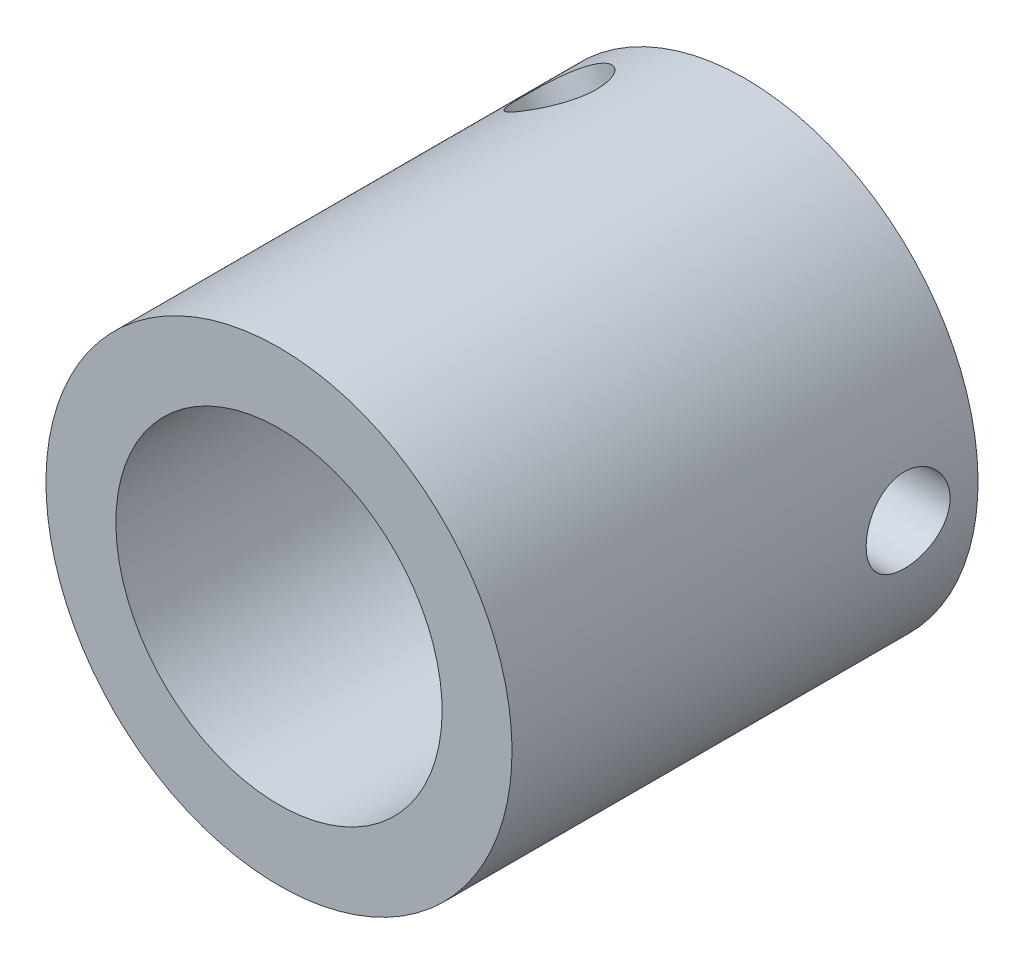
ISO-10303-21;
HEADER;
FILE_DESCRIPTION(('STEP AP214'),'2;1');
FILE_NAME('part.step','',(''),(''),'','','');
FILE_SCHEMA(('AUTOMOTIVE_DESIGN { 1 0 10303 214 1 1 1 1 }'));
ENDSEC;
DATA;
#1=APPLICATION_CONTEXT('core data for automotive mechanical design processes');
#2=APPLICATION_PROTOCOL_DEFINITION('international standard','automotive_design',2000,#1);
#3=PRODUCT_CONTEXT('',#1,'mechanical');
#4=PRODUCT('Part','Part','',(#3));
#5=PRODUCT_RELATED_PRODUCT_CATEGORY('part','',(#4));
#6=PRODUCT_DEFINITION_FORMATION('','',#4);
#7=PRODUCT_DEFINITION_CONTEXT('part definition',#1,'design');
#8=PRODUCT_DEFINITION('design','',#6,#7);
#9=PRODUCT_DEFINITION_SHAPE('','',#8);
#10=(LENGTH_UNIT() NAMED_UNIT(*) SI_UNIT(.MILLI.,.METRE.));
#11=(NAMED_UNIT(*) PLANE_ANGLE_UNIT() SI_UNIT($,.RADIAN.));
#12=(NAMED_UNIT(*) SI_UNIT($,.STERADIAN.) SOLID_ANGLE_UNIT());
#13=UNCERTAINTY_MEASURE_WITH_UNIT(LENGTH_MEASURE(1.E-05),#10,'distance_accuracy_value','');
#14=(GEOMETRIC_REPRESENTATION_CONTEXT(3) GLOBAL_UNCERTAINTY_ASSIGNED_CONTEXT((#13)) GLOBAL_UNIT_ASSIGNED_CONTEXT((#10,
#11,#12)) REPRESENTATION_CONTEXT('',''));
#15=CARTESIAN_POINT('',(0.,0.,0.));
#16=DIRECTION('',(0.,0.,1.));
#17=DIRECTION('',(1.,0.,0.));
#18=AXIS2_PLACEMENT_3D('',#15,#16,#17);
#19=CARTESIAN_POINT('',(10.,0.,3.));
#20=DIRECTION('',(1.,0.,0.));
#21=DIRECTION('',(0.,0.,1.));
#22=AXIS2_PLACEMENT_3D('',#19,#20,#21);
#23=CYLINDRICAL_SURFACE('',#22,1.8);
#24=CARTESIAN_POINT('',(7.,0.,1.2));
#25=CARTESIAN_POINT('',(6.99999696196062,-0.099240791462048,1.20000512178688));
#26=CARTESIAN_POINT('',(6.99786614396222,-0.198597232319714,1.20824378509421));
#27=CARTESIAN_POINT('',(6.98956324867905,-0.394546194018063,1.24095616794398));
#28=CARTESIAN_POINT('',(6.98338362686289,-0.491133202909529,1.2654601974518));
#29=CARTESIAN_POINT('',(6.96766786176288,-0.678551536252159,1.32986101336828));
#30=CARTESIAN_POINT('',(6.95813762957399,-0.769392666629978,1.36973070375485));
#31=CARTESIAN_POINT('',(6.93673479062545,-0.943067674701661,1.46364971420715));
#32=CARTESIAN_POINT('',(6.92486276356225,-1.02590352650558,1.51769552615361));
#33=CARTESIAN_POINT('',(6.89977071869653,-1.18305816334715,1.63968386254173));
#34=CARTESIAN_POINT('',(6.88652883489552,-1.25717810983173,1.70787808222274));
#35=CARTESIAN_POINT('',(6.86033226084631,-1.39306905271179,1.85569215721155));
#36=CARTESIAN_POINT('',(6.84737762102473,-1.45483789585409,1.93531400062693));
#37=CARTESIAN_POINT('',(6.82300297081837,-1.56521104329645,2.10527107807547));
#38=CARTESIAN_POINT('',(6.81161044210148,-1.61359192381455,2.19575570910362));
#39=CARTESIAN_POINT('',(6.79196771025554,-1.69437746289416,2.38391385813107));
#40=CARTESIAN_POINT('',(6.7837169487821,-1.72678496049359,2.481586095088));
#41=CARTESIAN_POINT('',(6.77151560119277,-1.77402502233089,2.67916770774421));
#42=CARTESIAN_POINT('',(6.76747790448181,-1.78921419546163,2.77898631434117));
#43=CARTESIAN_POINT('',(6.76389931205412,-1.80269763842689,2.97983039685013));
#44=CARTESIAN_POINT('',(6.76435764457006,-1.80099480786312,3.0808556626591));
#45=CARTESIAN_POINT('',(6.76964115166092,-1.78102655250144,3.27849027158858));
#46=CARTESIAN_POINT('',(6.77435352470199,-1.76318893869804,3.3751463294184));
#47=CARTESIAN_POINT('',(6.78743407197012,-1.71214085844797,3.56404630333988));
#48=CARTESIAN_POINT('',(6.79580254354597,-1.67892914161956,3.65628985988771));
#49=CARTESIAN_POINT('',(6.81535434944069,-1.59771670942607,3.83488185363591));
#50=CARTESIAN_POINT('',(6.82656665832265,-1.54956254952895,3.92115720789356));
#51=CARTESIAN_POINT('',(6.85052581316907,-1.43994268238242,4.0845492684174));
#52=CARTESIAN_POINT('',(6.86327284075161,-1.37847539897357,4.16166488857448));
#53=CARTESIAN_POINT('',(6.88933626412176,-1.24178154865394,4.30699106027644));
#54=CARTESIAN_POINT('',(6.90265825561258,-1.16619685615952,4.37486415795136));
#55=CARTESIAN_POINT('',(6.92803148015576,-1.00452224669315,4.49706525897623));
#56=CARTESIAN_POINT('',(6.94008216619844,-0.918427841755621,4.55138744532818));
#57=CARTESIAN_POINT('',(6.96162243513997,-0.73765468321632,4.64507793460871));
#58=CARTESIAN_POINT('',(6.97110010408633,-0.642938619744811,4.6843770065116));
#59=CARTESIAN_POINT('',(6.98632522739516,-0.448060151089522,4.74632580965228));
#60=CARTESIAN_POINT('',(6.99208043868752,-0.34790954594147,4.76901017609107));
#61=CARTESIAN_POINT('',(6.99709554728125,-0.205771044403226,4.78867719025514));
#62=CARTESIAN_POINT('',(6.99818199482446,-0.164745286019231,4.79291906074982));
#63=CARTESIAN_POINT('',(6.99963485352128,-0.0824863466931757,4.79858153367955));
#64=CARTESIAN_POINT('',(7.00000126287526,-0.0412531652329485,4.80000212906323));
#65=CARTESIAN_POINT('',(6.99999696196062,0.0992407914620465,4.79999487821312));
#66=CARTESIAN_POINT('',(6.99786614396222,0.198597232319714,4.79175621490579));
#67=CARTESIAN_POINT('',(6.98956324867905,0.394546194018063,4.75904383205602));
#68=CARTESIAN_POINT('',(6.98338362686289,0.49113320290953,4.7345398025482));
#69=CARTESIAN_POINT('',(6.96766786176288,0.67855153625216,4.67013898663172));
#70=CARTESIAN_POINT('',(6.95813762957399,0.769392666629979,4.63026929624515));
#71=CARTESIAN_POINT('',(6.93673479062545,0.943067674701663,4.53635028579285));
#72=CARTESIAN_POINT('',(6.92486276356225,1.02590352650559,4.48230447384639));
#73=CARTESIAN_POINT('',(6.89977071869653,1.18305816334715,4.36031613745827));
#74=CARTESIAN_POINT('',(6.88652883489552,1.25717810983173,4.29212191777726));
#75=CARTESIAN_POINT('',(6.86033226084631,1.39306905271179,4.14430784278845));
#76=CARTESIAN_POINT('',(6.84737762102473,1.45483789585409,4.06468599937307));
#77=CARTESIAN_POINT('',(6.82300297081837,1.56521104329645,3.89472892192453));
#78=CARTESIAN_POINT('',(6.81161044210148,1.61359192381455,3.80424429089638));
#79=CARTESIAN_POINT('',(6.79196771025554,1.69437746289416,3.61608614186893));
#80=CARTESIAN_POINT('',(6.7837169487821,1.72678496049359,3.518413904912));
#81=CARTESIAN_POINT('',(6.77151560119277,1.77402502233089,3.32083229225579));
#82=CARTESIAN_POINT('',(6.76747790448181,1.78921419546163,3.22101368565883));
#83=CARTESIAN_POINT('',(6.76389931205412,1.80269763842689,3.02016960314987));
#84=CARTESIAN_POINT('',(6.76435764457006,1.80099480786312,2.91914433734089));
#85=CARTESIAN_POINT('',(6.76964115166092,1.78102655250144,2.72150972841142));
#86=CARTESIAN_POINT('',(6.77435352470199,1.76318893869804,2.6248536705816));
#87=CARTESIAN_POINT('',(6.78743407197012,1.71214085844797,2.43595369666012));
#88=CARTESIAN_POINT('',(6.79580254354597,1.67892914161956,2.34371014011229));
#89=CARTESIAN_POINT('',(6.81535434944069,1.59771670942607,2.16511814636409));
#90=CARTESIAN_POINT('',(6.82656665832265,1.54956254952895,2.07884279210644));
#91=CARTESIAN_POINT('',(6.85052581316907,1.43994268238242,1.9154507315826));
#92=CARTESIAN_POINT('',(6.86327284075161,1.37847539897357,1.83833511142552));
#93=CARTESIAN_POINT('',(6.88933626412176,1.24178154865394,1.69300893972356));
#94=CARTESIAN_POINT('',(6.90265825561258,1.16619685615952,1.62513584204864));
#95=CARTESIAN_POINT('',(6.92803148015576,1.00452224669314,1.50293474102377));
#96=CARTESIAN_POINT('',(6.94008216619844,0.918427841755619,1.44861255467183));
#97=CARTESIAN_POINT('',(6.96162243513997,0.737654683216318,1.35492206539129));
#98=CARTESIAN_POINT('',(6.97110010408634,0.64293861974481,1.3156229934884));
#99=CARTESIAN_POINT('',(6.98632522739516,0.448060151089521,1.25367419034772));
#100=CARTESIAN_POINT('',(6.99208043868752,0.347909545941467,1.23098982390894));
#101=CARTESIAN_POINT('',(6.99709554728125,0.205771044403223,1.21132280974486));
#102=CARTESIAN_POINT('',(6.99818199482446,0.164745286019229,1.20708093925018));
#103=CARTESIAN_POINT('',(6.99963485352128,0.0824863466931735,1.20141846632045));
#104=CARTESIAN_POINT('',(7.00000126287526,0.0412531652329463,1.19999787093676));
#105=CARTESIAN_POINT('',(7.,0.,1.2));
#106=B_SPLINE_CURVE_WITH_KNOTS('',3,(#24,#25,#26,#27,#28,#29,#30,#31,#32,#33,#34,#35,#36,#37,
#38,#39,#40,#41,#42,#43,#44,#45,#46,#47,#48,#49,#50,#51,#52,#53,#54,#55,#56,#57,#58,#59,#60,#61,
#62,#63,#64,#65,#66,#67,#68,#69,#70,#71,#72,#73,#74,#75,#76,#77,#78,#79,#80,#81,#82,#83,#84,#85,
#86,#87,#88,#89,#90,#91,#92,#93,#94,#95,#96,#97,#98,#99,#100,#101,#102,#103,#104,#105),
.UNSPECIFIED.,.T.,.F.,(4,2,2,2,2,2,2,2,2,2,2,2,2,2,2,2,2,2,2,2,2,2,2,2,2,2,2,2,2,2,2,2,2,2,2,2,
2,2,2,2,4),(0.,0.297564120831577,0.595684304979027,0.893281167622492,1.19080445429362,
1.49416126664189,1.79757091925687,2.10577452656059,2.41392333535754,2.71556628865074,
3.01715746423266,3.31097913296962,3.60482470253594,3.90179364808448,4.19879777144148,
4.50473171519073,4.81079676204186,5.11825571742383,5.42507190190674,5.54876530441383,
5.67245901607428,5.97002313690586,6.26814332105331,6.56574018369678,6.8632634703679,
7.16662028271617,7.47002993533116,7.77823354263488,8.08638235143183,8.38802530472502,
8.68961648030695,8.98343814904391,9.27728371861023,9.57425266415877,9.87125678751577,
10.177190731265,10.4832557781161,10.7907147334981,11.097530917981,11.2212243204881,
11.3449180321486),.UNSPECIFIED.);
#107=CARTESIAN_POINT('',(7.,0.,1.2));
#108=VERTEX_POINT('',#107);
#109=EDGE_CURVE('E16',#108,#108,#106,.T.);
#110=ORIENTED_EDGE('',*,*,#109,.T.);
#111=EDGE_LOOP('',(#110));
#112=FACE_BOUND('',#111,.T.);
#113=CARTESIAN_POINT('',(10.,0.,1.2));
#114=CARTESIAN_POINT('',(9.99999792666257,-0.100138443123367,1.20000468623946));
#115=CARTESIAN_POINT('',(9.99847890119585,-0.200403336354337,1.20839204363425));
#116=CARTESIAN_POINT('',(9.99256124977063,-0.398189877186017,1.2417225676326));
#117=CARTESIAN_POINT('',(9.98815683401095,-0.495705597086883,1.26669902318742));
#118=CARTESIAN_POINT('',(9.97696172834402,-0.684989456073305,1.33242473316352));
#119=CARTESIAN_POINT('',(9.9701741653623,-0.776764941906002,1.37315332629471));
#120=CARTESIAN_POINT('',(9.95495763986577,-0.952142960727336,1.46917704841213));
#121=CARTESIAN_POINT('',(9.9465292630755,-1.03574839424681,1.52446698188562));
#122=CARTESIAN_POINT('',(9.92885621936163,-1.19338882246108,1.64870648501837));
#123=CARTESIAN_POINT('',(9.91960421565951,-1.26731946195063,1.7177874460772));
#124=CARTESIAN_POINT('',(9.90138142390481,-1.40261092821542,1.86736851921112));
#125=CARTESIAN_POINT('',(9.89241066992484,-1.46397023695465,1.94787000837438));
#126=CARTESIAN_POINT('',(9.87569637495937,-1.57279517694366,2.11872462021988));
#127=CARTESIAN_POINT('',(9.86796217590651,-1.6201571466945,2.20914476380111));
#128=CARTESIAN_POINT('',(9.85469826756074,-1.69897904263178,2.39681974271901));
#129=CARTESIAN_POINT('',(9.84916836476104,-1.73044036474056,2.49407397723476));
#130=CARTESIAN_POINT('',(9.84101185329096,-1.77623939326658,2.6915561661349));
#131=CARTESIAN_POINT('',(9.8383548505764,-1.79075649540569,2.79174123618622));
#132=CARTESIAN_POINT('',(9.83615323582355,-1.80281159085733,2.99315783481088));
#133=CARTESIAN_POINT('',(9.83660837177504,-1.80035095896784,3.09438927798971));
#134=CARTESIAN_POINT('',(9.84055190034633,-1.77866619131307,3.29373143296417));
#135=CARTESIAN_POINT('',(9.84400352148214,-1.75964526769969,3.39186508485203));
#136=CARTESIAN_POINT('',(9.85349347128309,-1.70569919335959,3.5835259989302));
#137=CARTESIAN_POINT('',(9.85953192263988,-1.67077328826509,3.67705304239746));
#138=CARTESIAN_POINT('',(9.87355429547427,-1.58580593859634,3.85744754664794));
#139=CARTESIAN_POINT('',(9.88154890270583,-1.53568109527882,3.94427486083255));
#140=CARTESIAN_POINT('',(9.89857482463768,-1.42180184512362,4.10835629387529));
#141=CARTESIAN_POINT('',(9.90760615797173,-1.35804719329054,4.18561024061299));
#142=CARTESIAN_POINT('',(9.92584751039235,-1.21763063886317,4.32952111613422));
#143=CARTESIAN_POINT('',(9.93505823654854,-1.14079701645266,4.39601049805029));
#144=CARTESIAN_POINT('',(9.95250580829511,-0.976936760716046,4.51520980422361));
#145=CARTESIAN_POINT('',(9.96074222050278,-0.889905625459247,4.56791360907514));
#146=CARTESIAN_POINT('',(9.97532870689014,-0.707929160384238,4.65806284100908));
#147=CARTESIAN_POINT('',(9.98167520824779,-0.612969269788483,4.69547941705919));
#148=CARTESIAN_POINT('',(9.99172969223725,-0.418096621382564,4.75370936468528));
#149=CARTESIAN_POINT('',(9.99544322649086,-0.318194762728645,4.77455768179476));
#150=CARTESIAN_POINT('',(9.99842222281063,-0.181296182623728,4.79121663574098));
#151=CARTESIAN_POINT('',(9.99901260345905,-0.145122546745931,4.79450767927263));
#152=CARTESIAN_POINT('',(9.99980186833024,-0.0726381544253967,4.7989002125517));
#153=CARTESIAN_POINT('',(10.0000007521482,-0.0363273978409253,4.80000170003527));
#154=CARTESIAN_POINT('',(9.99999792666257,0.100138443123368,4.79999531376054));
#155=CARTESIAN_POINT('',(9.99847890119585,0.200403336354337,4.79160795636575));
#156=CARTESIAN_POINT('',(9.99256124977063,0.398189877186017,4.7582774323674));
#157=CARTESIAN_POINT('',(9.98815683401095,0.495705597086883,4.73330097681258));
#158=CARTESIAN_POINT('',(9.97696172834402,0.684989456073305,4.66757526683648));
#159=CARTESIAN_POINT('',(9.9701741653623,0.776764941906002,4.62684667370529));
#160=CARTESIAN_POINT('',(9.95495763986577,0.952142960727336,4.53082295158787));
#161=CARTESIAN_POINT('',(9.9465292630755,1.03574839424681,4.47553301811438));
#162=CARTESIAN_POINT('',(9.92885621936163,1.19338882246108,4.35129351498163));
#163=CARTESIAN_POINT('',(9.91960421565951,1.26731946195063,4.2822125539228));
#164=CARTESIAN_POINT('',(9.90138142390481,1.40261092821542,4.13263148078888));
#165=CARTESIAN_POINT('',(9.89241066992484,1.46397023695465,4.05212999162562));
#166=CARTESIAN_POINT('',(9.87569637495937,1.57279517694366,3.88127537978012));
#167=CARTESIAN_POINT('',(9.86796217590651,1.6201571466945,3.79085523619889));
#168=CARTESIAN_POINT('',(9.85469826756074,1.69897904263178,3.60318025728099));
#169=CARTESIAN_POINT('',(9.84916836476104,1.73044036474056,3.50592602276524));
#170=CARTESIAN_POINT('',(9.84101185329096,1.77623939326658,3.3084438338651));
#171=CARTESIAN_POINT('',(9.8383548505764,1.79075649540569,3.20825876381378));
#172=CARTESIAN_POINT('',(9.83615323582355,1.80281159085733,3.00684216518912));
#173=CARTESIAN_POINT('',(9.83660837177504,1.80035095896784,2.90561072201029));
#174=CARTESIAN_POINT('',(9.84055190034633,1.77866619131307,2.70626856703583));
#175=CARTESIAN_POINT('',(9.84400352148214,1.75964526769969,2.60813491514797));
#176=CARTESIAN_POINT('',(9.85349347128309,1.70569919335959,2.4164740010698));
#177=CARTESIAN_POINT('',(9.85953192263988,1.67077328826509,2.32294695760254));
#178=CARTESIAN_POINT('',(9.87355429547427,1.58580593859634,2.14255245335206));
#179=CARTESIAN_POINT('',(9.88154890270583,1.53568109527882,2.05572513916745));
#180=CARTESIAN_POINT('',(9.89857482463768,1.42180184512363,1.89164370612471));
#181=CARTESIAN_POINT('',(9.90760615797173,1.35804719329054,1.81438975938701));
#182=CARTESIAN_POINT('',(9.92584751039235,1.21763063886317,1.67047888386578));
#183=CARTESIAN_POINT('',(9.93505823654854,1.14079701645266,1.60398950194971));
#184=CARTESIAN_POINT('',(9.95250580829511,0.976936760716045,1.48479019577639));
#185=CARTESIAN_POINT('',(9.96074222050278,0.889905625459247,1.43208639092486));
#186=CARTESIAN_POINT('',(9.97532870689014,0.707929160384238,1.34193715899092));
#187=CARTESIAN_POINT('',(9.98167520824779,0.612969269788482,1.30452058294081));
#188=CARTESIAN_POINT('',(9.99172969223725,0.418096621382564,1.24629063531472));
#189=CARTESIAN_POINT('',(9.99544322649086,0.318194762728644,1.22544231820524));
#190=CARTESIAN_POINT('',(9.99842222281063,0.181296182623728,1.20878336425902));
#191=CARTESIAN_POINT('',(9.99901260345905,0.145122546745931,1.20549232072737));
#192=CARTESIAN_POINT('',(9.99980186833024,0.0726381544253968,1.2010997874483));
#193=CARTESIAN_POINT('',(10.0000007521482,0.0363273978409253,1.19999829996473));
#194=CARTESIAN_POINT('',(10.,0.,1.2));
#195=B_SPLINE_CURVE_WITH_KNOTS('',3,(#113,#114,#115,#116,#117,#118,#119,#120,#121,#122,#123,
#124,#125,#126,#127,#128,#129,#130,#131,#132,#133,#134,#135,#136,#137,#138,#139,#140,#141,#142,
#143,#144,#145,#146,#147,#148,#149,#150,#151,#152,#153,#154,#155,#156,#157,#158,#159,#160,#161,
#162,#163,#164,#165,#166,#167,#168,#169,#170,#171,#172,#173,#174,#175,#176,#177,#178,#179,#180,
#181,#182,#183,#184,#185,#186,#187,#188,#189,#190,#191,#192,#193,#194),.UNSPECIFIED.,.T.,.F.,(4,
2,2,2,2,2,2,2,2,2,2,2,2,2,2,2,2,2,2,2,2,2,2,2,2,2,2,2,2,2,2,2,2,2,2,2,2,2,2,2,4),(0.,
0.300276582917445,0.601157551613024,0.901645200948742,1.20202578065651,1.50541792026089,
1.808846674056,2.11446927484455,2.42006504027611,2.72239510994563,3.02470069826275,
3.3233481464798,3.62200976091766,3.92234077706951,4.22267719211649,4.52731338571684,
4.83208457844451,5.13742832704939,5.44212632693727,5.55105807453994,5.65998993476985,
5.9602665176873,6.26114748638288,6.56163513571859,6.86201571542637,7.16540785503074,
7.46883660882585,7.7744592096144,8.08005497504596,8.38238504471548,8.6846906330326,
8.98333808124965,9.28199969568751,9.58233071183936,9.88266712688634,10.1873033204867,
10.4920745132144,10.7974182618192,11.1021162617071,11.2110480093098,11.3199798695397),.UNSPECIFIED.);
#196=CARTESIAN_POINT('',(10.,0.,1.2));
#197=VERTEX_POINT('',#196);
#198=EDGE_CURVE('E45',#197,#197,#195,.T.);
#199=ORIENTED_EDGE('',*,*,#198,.F.);
#200=EDGE_LOOP('',(#199));
#201=FACE_BOUND('',#200,.T.);
#202=ADVANCED_FACE('F12',(#112,#201),#23,.F.);
#203=CARTESIAN_POINT('',(0.,0.,45.4558441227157));
#204=DIRECTION('',(0.,0.,-1.));
#205=DIRECTION('',(0.,1.,0.));
#206=AXIS2_PLACEMENT_3D('',#203,#204,#205);
#207=CYLINDRICAL_SURFACE('',#206,7.);
#208=CARTESIAN_POINT('',(0.,0.,0.));
#209=DIRECTION('',(0.,0.,-1.));
#210=DIRECTION('',(0.,1.,0.));
#211=AXIS2_PLACEMENT_3D('',#208,#209,#210);
#212=CIRCLE('',#211,7.);
#213=CARTESIAN_POINT('',(0.,7.,0.));
#214=VERTEX_POINT('',#213);
#215=EDGE_CURVE('E51',#214,#214,#212,.T.);
#216=ORIENTED_EDGE('',*,*,#215,.T.);
#217=EDGE_LOOP('',(#216));
#218=FACE_BOUND('',#217,.T.);
#219=CARTESIAN_POINT('',(0.,0.,20.));
#220=DIRECTION('',(0.,0.,-1.));
#221=DIRECTION('',(0.,1.,0.));
#222=AXIS2_PLACEMENT_3D('',#219,#220,#221);
#223=CIRCLE('',#222,7.);
#224=CARTESIAN_POINT('',(0.,7.,20.));
#225=VERTEX_POINT('',#224);
#226=EDGE_CURVE('E52',#225,#225,#223,.T.);
#227=ORIENTED_EDGE('',*,*,#226,.F.);
#228=EDGE_LOOP('',(#227));
#229=FACE_BOUND('',#228,.T.);
#230=CARTESIAN_POINT('',(-4.94115263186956,4.9583274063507,3.));
#231=CARTESIAN_POINT('',(-4.94114986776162,4.95833295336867,3.09917960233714));
#232=CARTESIAN_POINT('',(-4.93512555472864,4.96435629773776,3.19847523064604));
#233=CARTESIAN_POINT('',(-4.9111147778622,4.98810828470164,3.39429739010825));
#234=CARTESIAN_POINT('',(-4.89310582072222,5.00585893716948,3.49081835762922));
#235=CARTESIAN_POINT('',(-4.84547659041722,5.05197446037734,3.67809685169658));
#236=CARTESIAN_POINT('',(-4.81587791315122,5.08031958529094,3.76886473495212));
#237=CARTESIAN_POINT('',(-4.74556047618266,5.14606276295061,3.94241571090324));
#238=CARTESIAN_POINT('',(-4.70484434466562,5.18345867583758,4.02520068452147));
#239=CARTESIAN_POINT('',(-4.61192603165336,5.2663160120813,4.18240686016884));
#240=CARTESIAN_POINT('',(-4.55949940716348,5.3119311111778,4.25661446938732));
#241=CARTESIAN_POINT('',(-4.44450093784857,5.408515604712,4.39267629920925));
#242=CARTESIAN_POINT('',(-4.381927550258,5.45948581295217,4.45452863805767));
#243=CARTESIAN_POINT('',(-4.24672214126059,5.56532283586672,4.56499418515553));
#244=CARTESIAN_POINT('',(-4.17395499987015,5.62023614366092,4.61339798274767));
#245=CARTESIAN_POINT('',(-4.02062080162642,5.73092800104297,4.6942285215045));
#246=CARTESIAN_POINT('',(-3.94005502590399,5.78670640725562,4.72665788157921));
#247=CARTESIAN_POINT('',(-3.77491722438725,5.89572518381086,4.77393624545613));
#248=CARTESIAN_POINT('',(-3.69046763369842,5.9489943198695,4.78914619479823));
#249=CARTESIAN_POINT('',(-3.51835268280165,6.05237683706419,4.80268805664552));
#250=CARTESIAN_POINT('',(-3.43068782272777,6.1024907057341,4.80102258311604));
#251=CARTESIAN_POINT('',(-3.25685288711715,6.19697287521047,4.78111823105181));
#252=CARTESIAN_POINT('',(-3.17069601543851,6.24144841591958,4.76326922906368));
#253=CARTESIAN_POINT('',(-3.00040889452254,6.32507314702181,4.71213230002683));
#254=CARTESIAN_POINT('',(-2.91627876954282,6.36422201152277,4.67884342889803));
#255=CARTESIAN_POINT('',(-2.75182121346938,6.43705305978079,4.59746222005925));
#256=CARTESIAN_POINT('',(-2.67153725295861,6.4706800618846,4.54923290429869));
#257=CARTESIAN_POINT('',(-2.51810766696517,6.53191912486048,4.43944755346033));
#258=CARTESIAN_POINT('',(-2.44496288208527,6.55953047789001,4.37788995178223));
#259=CARTESIAN_POINT('',(-2.30617433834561,6.60962666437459,4.24112531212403));
#260=CARTESIAN_POINT('',(-2.24080294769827,6.63194343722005,4.16557998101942));
#261=CARTESIAN_POINT('',(-2.12234581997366,6.67079811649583,4.00402244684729));
#262=CARTESIAN_POINT('',(-2.06926556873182,6.68733344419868,3.9180055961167));
#263=CARTESIAN_POINT('',(-1.97720587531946,6.71513159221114,3.73726593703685));
#264=CARTESIAN_POINT('',(-1.93831497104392,6.72636143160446,3.64249293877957));
#265=CARTESIAN_POINT('',(-1.87686115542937,6.74376963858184,3.44748876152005));
#266=CARTESIAN_POINT('',(-1.85426385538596,6.74995864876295,3.34726956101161));
#267=CARTESIAN_POINT('',(-1.83470392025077,6.75528566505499,3.20517722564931));
#268=CARTESIAN_POINT('',(-1.83049304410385,6.75642685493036,3.16426969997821));
#269=CARTESIAN_POINT('',(-1.8248703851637,6.75794764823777,3.08224810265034));
#270=CARTESIAN_POINT('',(-1.82345861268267,6.75832724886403,3.04113403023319));
#271=CARTESIAN_POINT('',(-1.82346736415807,6.75832778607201,2.90082039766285));
#272=CARTESIAN_POINT('',(-1.83169588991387,6.75612225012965,2.80152476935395));
#273=CARTESIAN_POINT('',(-1.86427110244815,6.74720430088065,2.60570260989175));
#274=CARTESIAN_POINT('',(-1.88864809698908,6.74048341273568,2.50918164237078));
#275=CARTESIAN_POINT('',(-1.95239992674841,6.72229305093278,2.32190314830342));
#276=CARTESIAN_POINT('',(-1.99174686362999,6.71083240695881,2.23113526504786));
#277=CARTESIAN_POINT('',(-2.08384084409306,6.68280730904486,2.05758428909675));
#278=CARTESIAN_POINT('',(-2.13658472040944,6.66624406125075,1.97479931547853));
#279=CARTESIAN_POINT('',(-2.25480043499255,6.6272031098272,1.81759313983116));
#280=CARTESIAN_POINT('',(-2.32051758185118,6.60460787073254,1.74338553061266));
#281=CARTESIAN_POINT('',(-2.4616614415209,6.55330852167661,1.60732370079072));
#282=CARTESIAN_POINT('',(-2.53708963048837,6.52460348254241,1.54547136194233));
#283=CARTESIAN_POINT('',(-2.696349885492,6.46043067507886,1.43500581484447));
#284=CARTESIAN_POINT('',(-2.78028977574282,6.42486913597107,1.38660201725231));
#285=CARTESIAN_POINT('',(-2.95281883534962,6.3474237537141,1.30577147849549));
#286=CARTESIAN_POINT('',(-3.0414072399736,6.30554094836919,1.27334211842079));
#287=CARTESIAN_POINT('',(-3.21838917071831,6.2170368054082,1.22606375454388));
#288=CARTESIAN_POINT('',(-3.30674639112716,6.1705358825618,1.21085380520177));
#289=CARTESIAN_POINT('',(-3.48233575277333,6.07317122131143,1.19731194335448));
#290=CARTESIAN_POINT('',(-3.56956806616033,6.0223081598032,1.19897741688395));
#291=CARTESIAN_POINT('',(-3.73830949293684,5.91900377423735,1.2188817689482));
#292=CARTESIAN_POINT('',(-3.81990487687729,5.8666275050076,1.23673077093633));
#293=CARTESIAN_POINT('',(-3.97746957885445,5.76096689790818,1.28786769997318));
#294=CARTESIAN_POINT('',(-4.05343855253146,5.70768250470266,1.32115657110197));
#295=CARTESIAN_POINT('',(-4.19874086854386,5.60167360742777,1.40253777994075));
#296=CARTESIAN_POINT('',(-4.26800468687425,5.54895915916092,1.45076709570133));
#297=CARTESIAN_POINT('',(-4.39775406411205,5.44670477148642,1.56055244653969));
#298=CARTESIAN_POINT('',(-4.45823858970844,5.39716520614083,1.62211004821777));
#299=CARTESIAN_POINT('',(-4.57101743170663,5.30201889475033,1.75887468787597));
#300=CARTESIAN_POINT('',(-4.62303001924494,5.25656399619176,1.8344200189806));
#301=CARTESIAN_POINT('',(-4.71590772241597,5.17340445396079,1.99597755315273));
#302=CARTESIAN_POINT('',(-4.75676786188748,5.1357032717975,2.08199440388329));
#303=CARTESIAN_POINT('',(-4.8268716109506,5.06987631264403,2.26273406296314));
#304=CARTESIAN_POINT('',(-4.85604238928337,5.04181072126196,2.35750706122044));
#305=CARTESIAN_POINT('',(-4.90184524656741,4.99729425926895,2.55251123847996));
#306=CARTESIAN_POINT('',(-4.91850373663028,4.98081892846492,2.65273043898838));
#307=CARTESIAN_POINT('',(-4.93289703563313,4.96654303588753,2.79482277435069));
#308=CARTESIAN_POINT('',(-4.93599077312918,4.96346690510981,2.83573030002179));
#309=CARTESIAN_POINT('',(-4.94011914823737,4.95935793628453,2.91775189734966));
#310=CARTESIAN_POINT('',(-4.94115377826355,4.9583251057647,2.95886596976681));
#311=CARTESIAN_POINT('',(-4.94115263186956,4.9583274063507,3.));
#312=B_SPLINE_CURVE_WITH_KNOTS('',3,(#230,#231,#232,#233,#234,#235,#236,#237,#238,#239,#240,
#241,#242,#243,#244,#245,#246,#247,#248,#249,#250,#251,#252,#253,#254,#255,#256,#257,#258,#259,
#260,#261,#262,#263,#264,#265,#266,#267,#268,#269,#270,#271,#272,#273,#274,#275,#276,#277,#278,
#279,#280,#281,#282,#283,#284,#285,#286,#287,#288,#289,#290,#291,#292,#293,#294,#295,#296,#297,
#298,#299,#300,#301,#302,#303,#304,#305,#306,#307,#308,#309,#310,#311),.UNSPECIFIED.,.T.,.F.,(4,
2,2,2,2,2,2,2,2,2,2,2,2,2,2,2,2,2,2,2,2,2,2,2,2,2,2,2,2,2,2,2,2,2,2,2,2,2,2,2,4),(0.,
0.297380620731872,0.595320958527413,0.892708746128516,1.19002629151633,1.49362376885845,
1.79726745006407,2.10540351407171,2.41348904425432,2.71498958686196,3.01644342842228,
3.3108224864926,3.60521954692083,3.902399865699,4.19961513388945,4.50528007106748,
4.81108117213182,5.1187590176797,5.42578557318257,5.54912160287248,5.67245808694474,
5.96983870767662,6.26777904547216,6.56516683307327,6.86248437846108,7.16608185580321,
7.46972553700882,7.77786160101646,8.08594713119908,8.38744767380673,8.68890151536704,
8.98328057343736,9.27767763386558,9.57485795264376,9.87207322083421,10.1777381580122,
10.4835392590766,10.7912171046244,11.0982436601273,11.2215796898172,11.3449161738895),.UNSPECIFIED.);
#313=CARTESIAN_POINT('',(-4.94115263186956,4.9583274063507,3.));
#314=VERTEX_POINT('',#313);
#315=EDGE_CURVE('E77',#314,#314,#312,.T.);
#316=ORIENTED_EDGE('',*,*,#315,.T.);
#317=EDGE_LOOP('',(#316));
#318=FACE_BOUND('',#317,.T.);
#319=ORIENTED_EDGE('',*,*,#109,.F.);
#320=EDGE_LOOP('',(#319));
#321=FACE_BOUND('',#320,.T.);
#322=ADVANCED_FACE('F62',(#218,#229,#318,#321),#207,.F.);
#323=CARTESIAN_POINT('',(0.,0.,20.));
#324=DIRECTION('',(0.,0.,1.));
#325=DIRECTION('',(0.,-1.,0.));
#326=AXIS2_PLACEMENT_3D('',#323,#324,#325);
#327=PLANE('',#326);
#328=ORIENTED_EDGE('',*,*,#226,.T.);
#329=EDGE_LOOP('',(#328));
#330=FACE_BOUND('',#329,.T.);
#331=CARTESIAN_POINT('',(0.,0.,20.));
#332=DIRECTION('',(0.,0.,-1.));
#333=DIRECTION('',(0.,1.,0.));
#334=AXIS2_PLACEMENT_3D('',#331,#332,#333);
#335=CIRCLE('',#334,10.);
#336=CARTESIAN_POINT('',(0.,10.,20.));
#337=VERTEX_POINT('',#336);
#338=EDGE_CURVE('E28',#337,#337,#335,.T.);
#339=ORIENTED_EDGE('',*,*,#338,.F.);
#340=EDGE_LOOP('',(#339));
#341=FACE_BOUND('',#340,.T.);
#342=ADVANCED_FACE('F64',(#330,#341),#327,.T.);
#343=CARTESIAN_POINT('',(0.,0.,0.));
#344=DIRECTION('',(0.,0.,1.));
#345=DIRECTION('',(0.,-1.,0.));
#346=AXIS2_PLACEMENT_3D('',#343,#344,#345);
#347=PLANE('',#346);
#348=ORIENTED_EDGE('',*,*,#215,.F.);
#349=EDGE_LOOP('',(#348));
#350=FACE_BOUND('',#349,.T.);
#351=CARTESIAN_POINT('',(0.,0.,0.));
#352=DIRECTION('',(0.,0.,-1.));
#353=DIRECTION('',(0.,1.,0.));
#354=AXIS2_PLACEMENT_3D('',#351,#352,#353);
#355=CIRCLE('',#354,10.);
#356=CARTESIAN_POINT('',(0.,10.,0.));
#357=VERTEX_POINT('',#356);
#358=EDGE_CURVE('E23',#357,#357,#355,.F.);
#359=ORIENTED_EDGE('',*,*,#358,.F.);
#360=EDGE_LOOP('',(#359));
#361=FACE_BOUND('',#360,.T.);
#362=ADVANCED_FACE('F71',(#350,#361),#347,.F.);
#363=CARTESIAN_POINT('',(-5.,8.66025403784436,3.));
#364=DIRECTION('',(-0.5,0.866025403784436,0.));
#365=DIRECTION('',(-0.866025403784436,-0.5,0.));
#366=AXIS2_PLACEMENT_3D('',#363,#364,#365);
#367=CYLINDRICAL_SURFACE('',#366,1.8);
#368=ORIENTED_EDGE('',*,*,#315,.F.);
#369=EDGE_LOOP('',(#368));
#370=FACE_BOUND('',#369,.T.);
#371=CARTESIAN_POINT('',(-6.4771787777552,7.6188027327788,3.));
#372=CARTESIAN_POINT('',(-6.47717580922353,7.61880698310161,2.89987639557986));
#373=CARTESIAN_POINT('',(-6.47068644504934,7.62433700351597,2.79962624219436));
#374=CARTESIAN_POINT('',(-6.44483457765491,7.64620053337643,2.60187040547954));
#375=CARTESIAN_POINT('',(-6.42544614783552,7.66255580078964,2.50437066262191));
#376=CARTESIAN_POINT('',(-6.37421453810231,7.70522498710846,2.31512059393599));
#377=CARTESIAN_POINT('',(-6.34238797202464,7.7315256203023,2.22336278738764));
#378=CARTESIAN_POINT('',(-6.26693437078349,7.79280979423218,2.04801451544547));
#379=CARTESIAN_POINT('',(-6.22331151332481,7.82779026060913,1.96442117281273));
#380=CARTESIAN_POINT('',(-6.1246056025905,7.90526230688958,1.8067676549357));
#381=CARTESIAN_POINT('',(-6.06940820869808,7.94782813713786,1.73281553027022));
#382=CARTESIAN_POINT('',(-5.94895032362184,8.03838649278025,1.5974824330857));
#383=CARTESIAN_POINT('',(-5.8836886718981,8.08637964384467,1.5361029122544));
#384=CARTESIAN_POINT('',(-5.74401420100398,8.18619010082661,1.42725636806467));
#385=CARTESIAN_POINT('',(-5.66954069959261,8.2380317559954,1.37988942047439));
#386=CARTESIAN_POINT('',(-5.5135724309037,8.34322213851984,1.30105739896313));
#387=CARTESIAN_POINT('',(-5.43207825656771,8.39657073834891,1.26959098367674));
#388=CARTESIAN_POINT('',(-5.26508535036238,8.50226626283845,1.22378199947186));
#389=CARTESIAN_POINT('',(-5.17963895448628,8.55461779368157,1.20925935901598));
#390=CARTESIAN_POINT('',(-5.00630940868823,8.6571937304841,1.19718952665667));
#391=CARTESIAN_POINT('',(-4.91842644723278,8.70741830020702,1.19964102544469));
#392=CARTESIAN_POINT('',(-4.74381824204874,8.80375038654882,1.22131086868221));
#393=CARTESIAN_POINT('',(-4.65709135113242,8.84989875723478,1.24033521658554));
#394=CARTESIAN_POINT('',(-4.48634526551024,8.93766900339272,1.29430467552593));
#395=CARTESIAN_POINT('',(-4.40232618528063,8.97929068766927,1.3292504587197));
#396=CARTESIAN_POINT('',(-4.23910830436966,9.05749423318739,1.41425989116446));
#397=CARTESIAN_POINT('',(-4.15993732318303,9.09404829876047,1.46440245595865));
#398=CARTESIAN_POINT('',(-4.00935476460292,9.16143489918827,1.57832003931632));
#399=CARTESIAN_POINT('',(-3.93794332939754,9.19226732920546,1.64209530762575));
#400=CARTESIAN_POINT('',(-3.80421461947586,9.24842115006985,1.78252710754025));
#401=CARTESIAN_POINT('',(-3.74203819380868,9.27365961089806,1.85935101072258));
#402=CARTESIAN_POINT('',(-3.63008074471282,9.31805527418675,2.02318310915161));
#403=CARTESIAN_POINT('',(-3.58030527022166,9.33720975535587,2.11019583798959));
#404=CARTESIAN_POINT('',(-3.49488097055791,9.36952004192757,2.29216608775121));
#405=CARTESIAN_POINT('',(-3.45926435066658,9.38266218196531,2.38714113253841));
#406=CARTESIAN_POINT('',(-3.40374434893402,9.40294697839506,2.58204697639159));
#407=CARTESIAN_POINT('',(-3.3838078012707,9.4101022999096,2.68196683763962));
#408=CARTESIAN_POINT('',(-3.36788185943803,9.41580493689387,2.81885406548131));
#409=CARTESIAN_POINT('',(-3.36473694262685,9.41692892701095,2.85499777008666));
#410=CARTESIAN_POINT('',(-3.36053873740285,9.41842790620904,2.9274221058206));
#411=CARTESIAN_POINT('',(-3.3594854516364,9.41880289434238,2.96370273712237));
#412=CARTESIAN_POINT('',(-3.35949248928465,9.41880228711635,3.10012360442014));
#413=CARTESIAN_POINT('',(-3.36752630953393,9.41594734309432,3.20037375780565));
#414=CARTESIAN_POINT('',(-3.39938661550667,9.40449073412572,3.39812959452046));
#415=CARTESIAN_POINT('',(-3.42324490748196,9.39587749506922,3.49562933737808));
#416=CARTESIAN_POINT('',(-3.48581331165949,9.37284421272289,3.68487940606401));
#417=CARTESIAN_POINT('',(-3.52450361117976,9.35843191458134,3.77663721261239));
#418=CARTESIAN_POINT('',(-3.61530406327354,9.32372926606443,3.95198548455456));
#419=CARTESIAN_POINT('',(-3.66740946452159,9.303440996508,4.03557882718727));
#420=CARTESIAN_POINT('',(-3.7838551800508,9.25669519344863,4.1932323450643));
#421=CARTESIAN_POINT('',(-3.84831696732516,9.23017576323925,4.26718446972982));
#422=CARTESIAN_POINT('',(-3.98697174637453,9.17113535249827,4.40251756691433));
#423=CARTESIAN_POINT('',(-4.06116586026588,9.13861367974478,4.4638970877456));
#424=CARTESIAN_POINT('',(-4.21744148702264,9.06755726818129,4.57274363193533));
#425=CARTESIAN_POINT('',(-4.29957442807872,9.02898215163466,4.62011057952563));
#426=CARTESIAN_POINT('',(-4.46865610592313,8.94650486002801,4.6989426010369));
#427=CARTESIAN_POINT('',(-4.55560443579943,8.90260313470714,4.73040901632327));
#428=CARTESIAN_POINT('',(-4.73063589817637,8.81083079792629,4.77621800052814));
#429=CARTESIAN_POINT('',(-4.81869685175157,8.76300781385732,4.79074064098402));
#430=CARTESIAN_POINT('',(-4.99419499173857,8.66418799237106,4.80281047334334));
#431=CARTESIAN_POINT('',(-5.08163222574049,8.6131914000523,4.80035897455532));
#432=CARTESIAN_POINT('',(-5.25236236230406,8.51014230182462,4.77868913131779));
#433=CARTESIAN_POINT('',(-5.33569146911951,8.45810879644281,4.75966478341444));
#434=CARTESIAN_POINT('',(-5.4970757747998,8.35412347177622,4.70569532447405));
#435=CARTESIAN_POINT('',(-5.57513075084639,8.30217165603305,4.6707495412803));
#436=CARTESIAN_POINT('',(-5.72446594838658,8.19992259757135,4.58574010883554));
#437=CARTESIAN_POINT('',(-5.79570818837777,8.14963554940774,4.53559754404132));
#438=CARTESIAN_POINT('',(-5.92935797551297,8.0529205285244,4.42167996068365));
#439=CARTESIAN_POINT('',(-5.99176536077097,8.0064926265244,4.35790469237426));
#440=CARTESIAN_POINT('',(-6.10726035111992,7.91875707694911,4.21747289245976));
#441=CARTESIAN_POINT('',(-6.16020571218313,7.87752994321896,4.14064898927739));
#442=CARTESIAN_POINT('',(-6.25463220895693,7.80276977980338,3.97681689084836));
#443=CARTESIAN_POINT('',(-6.29610821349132,7.76924019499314,3.88980416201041));
#444=CARTESIAN_POINT('',(-6.36680189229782,7.71141572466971,3.7078339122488));
#445=CARTESIAN_POINT('',(-6.39599162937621,7.68714189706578,3.61285886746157));
#446=CARTESIAN_POINT('',(-6.44131877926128,7.64920256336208,3.41795302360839));
#447=CARTESIAN_POINT('',(-6.45748374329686,7.6355146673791,3.31803316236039));
#448=CARTESIAN_POINT('',(-6.47038534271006,7.624573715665,3.18114593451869));
#449=CARTESIAN_POINT('',(-6.47293120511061,7.6224121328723,3.14500222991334));
#450=CARTESIAN_POINT('',(-6.4763284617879,7.61952587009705,3.0725778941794));
#451=CARTESIAN_POINT('',(-6.47717985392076,7.61880119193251,3.03629726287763));
#452=CARTESIAN_POINT('',(-6.4771787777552,7.6188027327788,3.));
#453=B_SPLINE_CURVE_WITH_KNOTS('',3,(#371,#372,#373,#374,#375,#376,#377,#378,#379,#380,#381,
#382,#383,#384,#385,#386,#387,#388,#389,#390,#391,#392,#393,#394,#395,#396,#397,#398,#399,#400,
#401,#402,#403,#404,#405,#406,#407,#408,#409,#410,#411,#412,#413,#414,#415,#416,#417,#418,#419,
#420,#421,#422,#423,#424,#425,#426,#427,#428,#429,#430,#431,#432,#433,#434,#435,#436,#437,#438,
#439,#440,#441,#442,#443,#444,#445,#446,#447,#448,#449,#450,#451,#452),.UNSPECIFIED.,.T.,.F.,(4,
2,2,2,2,2,2,2,2,2,2,2,2,2,2,2,2,2,2,2,2,2,2,2,2,2,2,2,2,2,2,2,2,2,2,2,2,2,2,2,4),(0.,
0.300232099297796,0.601069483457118,0.901506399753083,1.2018370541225,1.50528752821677,
1.8087730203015,2.11437635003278,2.41995389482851,2.72225341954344,3.02452962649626,
3.32331431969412,3.62211162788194,3.92248795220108,4.22286977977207,4.52744433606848,
4.83215493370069,5.13755470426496,5.44230675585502,5.55114811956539,5.65998962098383,
5.96022172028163,6.26105910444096,6.56149602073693,6.86182667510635,7.16527714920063,
7.46876264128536,7.77436597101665,8.07994351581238,8.3822430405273,8.68451924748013,
8.98330394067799,9.28210124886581,9.58247757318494,9.88285940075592,10.1874339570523,
10.4921445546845,10.7975443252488,11.1022963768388,11.2111377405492,11.3199792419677),.UNSPECIFIED.);
#454=CARTESIAN_POINT('',(-6.4771787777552,7.6188027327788,3.));
#455=VERTEX_POINT('',#454);
#456=EDGE_CURVE('E8',#455,#455,#453,.T.);
#457=ORIENTED_EDGE('',*,*,#456,.F.);
#458=EDGE_LOOP('',(#457));
#459=FACE_BOUND('',#458,.T.);
#460=ADVANCED_FACE('F36',(#370,#459),#367,.F.);
#461=CARTESIAN_POINT('',(0.,0.,20.));
#462=DIRECTION('',(0.,0.,-1.));
#463=DIRECTION('',(0.,1.,0.));
#464=AXIS2_PLACEMENT_3D('',#461,#462,#463);
#465=CYLINDRICAL_SURFACE('',#464,10.);
#466=ORIENTED_EDGE('',*,*,#338,.T.);
#467=EDGE_LOOP('',(#466));
#468=FACE_BOUND('',#467,.T.);
#469=ORIENTED_EDGE('',*,*,#456,.T.);
#470=EDGE_LOOP('',(#469));
#471=FACE_BOUND('',#470,.T.);
#472=ORIENTED_EDGE('',*,*,#358,.T.);
#473=EDGE_LOOP('',(#472));
#474=FACE_BOUND('',#473,.T.);
#475=ORIENTED_EDGE('',*,*,#198,.T.);
#476=EDGE_LOOP('',(#475));
#477=FACE_BOUND('',#476,.T.);
#478=ADVANCED_FACE('F39',(#468,#471,#474,#477),#465,.T.);
#479=CLOSED_SHELL('',(#202,#322,#342,#362,#460,#478));
#480=MANIFOLD_SOLID_BREP('B1',#479);
#481=ADVANCED_BREP_SHAPE_REPRESENTATION('',(#18,#480),#14);
#482=SHAPE_DEFINITION_REPRESENTATION(#9,#481);
ENDSEC;
END-ISO-10303-21;
